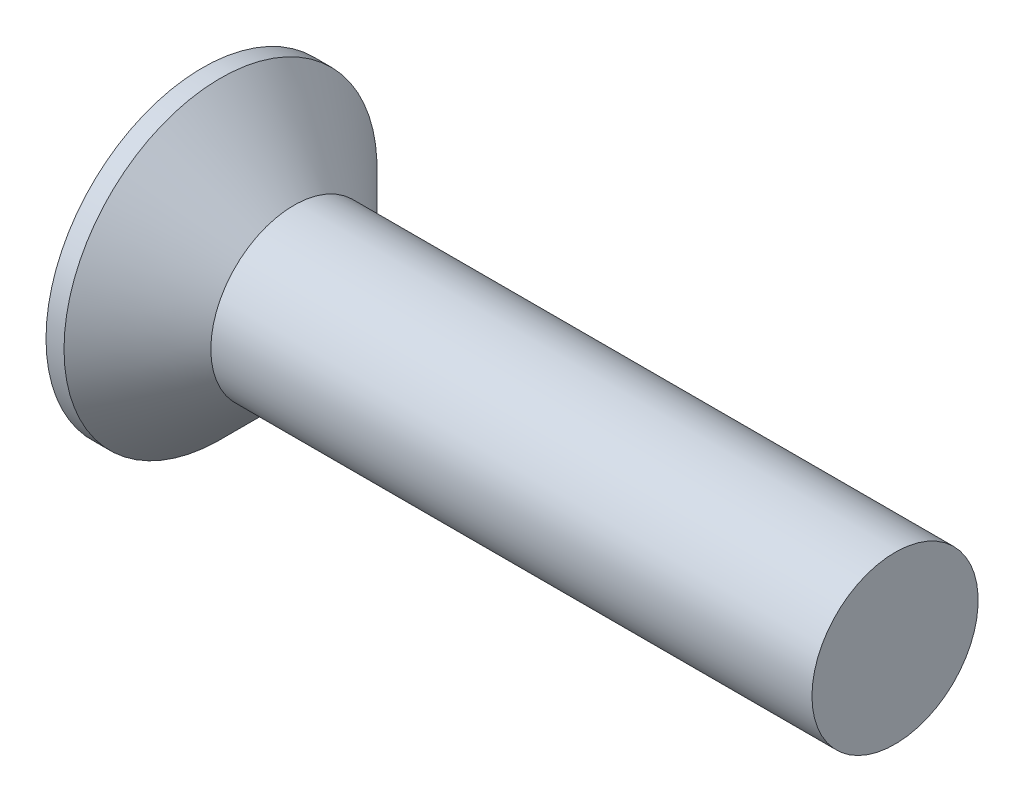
from build123d import *

# Parameters (mm, degrees)
CIRPATTERN1_COUNT = 2
CIRPATTERN1_ANGLE = 90


with BuildPart() as part:
    # BodySke → Base-Revolve (revolve)
    with BuildSketch(Plane.XY, mode=Mode.PRIVATE) as base_revolve_sk:
        Polygon((0, 0), (0, 5.65), (0.65, 5.65), (3.3, 3), (25, 3), (25, 0), align=None)
    revolve(base_revolve_sk.sketch.rotate(Axis((-6.35, 0, 0), (1, 0, 0)), 90), axis=Axis((-6.35, 0, 0), (1, 0, 0)))

    # Sketch3 → Cross section 0
    with BuildSketch(Plane.ZY):
        with BuildLine():
            Line((-0.56, 3.31), (0.56, 3.31))
            Line((0.56, 3.31), (0.56, -3.31))
            Line((0.56, -3.31), (-0.56, -3.31))
            Line((-0.56, -3.31), (-0.56, 3.31))
        make_face()
    # Sketch4 → Cross section 1
    with BuildSketch(Plane.ZY.offset(-3.61)):
        with BuildLine():
            Line((-0.28, 0.28), (0.28, 0.28))
            Line((0.28, 0.28), (0.28, -0.28))
            Line((0.28, -0.28), (-0.28, -0.28))
            Line((-0.28, -0.28), (-0.28, 0.28))
        make_face()
    cross = loft(mode=Mode.SUBTRACT)

    # CirPattern1: Cross ×2 about axis
    cirpattern1_axis = Axis((0, 0, 0), (1, 0, 0))
    for i in range(1, CIRPATTERN1_COUNT):
        add(cross.rotate(cirpattern1_axis, i * CIRPATTERN1_ANGLE / (CIRPATTERN1_COUNT - 1)), mode=Mode.SUBTRACT)


solid = part.part
